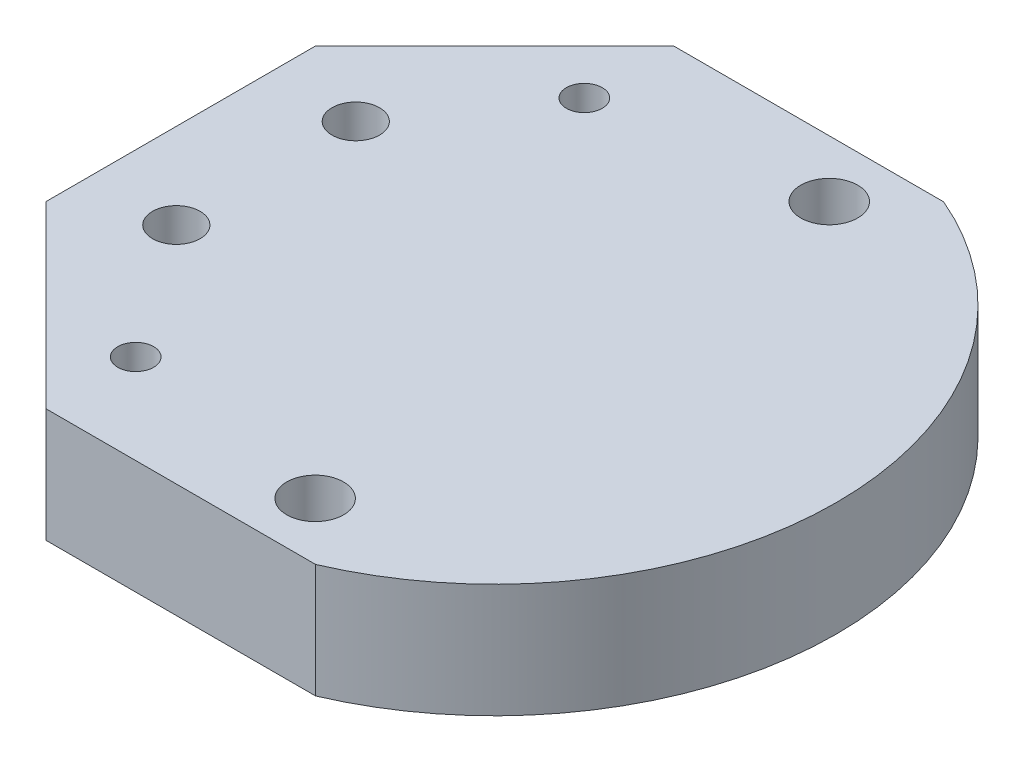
ISO-10303-21;
HEADER;
FILE_DESCRIPTION(('STEP AP214'),'2;1');
FILE_NAME('part.step','',(''),(''),'','','');
FILE_SCHEMA(('AUTOMOTIVE_DESIGN { 1 0 10303 214 1 1 1 1 }'));
ENDSEC;
DATA;
#1=APPLICATION_CONTEXT('core data for automotive mechanical design processes');
#2=APPLICATION_PROTOCOL_DEFINITION('international standard','automotive_design',2000,#1);
#3=PRODUCT_CONTEXT('',#1,'mechanical');
#4=PRODUCT('Part','Part','',(#3));
#5=PRODUCT_RELATED_PRODUCT_CATEGORY('part','',(#4));
#6=PRODUCT_DEFINITION_FORMATION('','',#4);
#7=PRODUCT_DEFINITION_CONTEXT('part definition',#1,'design');
#8=PRODUCT_DEFINITION('design','',#6,#7);
#9=PRODUCT_DEFINITION_SHAPE('','',#8);
#10=(LENGTH_UNIT() NAMED_UNIT(*) SI_UNIT(.MILLI.,.METRE.));
#11=(NAMED_UNIT(*) PLANE_ANGLE_UNIT() SI_UNIT($,.RADIAN.));
#12=(NAMED_UNIT(*) SI_UNIT($,.STERADIAN.) SOLID_ANGLE_UNIT());
#13=UNCERTAINTY_MEASURE_WITH_UNIT(LENGTH_MEASURE(1.E-05),#10,'distance_accuracy_value','');
#14=(GEOMETRIC_REPRESENTATION_CONTEXT(3) GLOBAL_UNCERTAINTY_ASSIGNED_CONTEXT((#13)) GLOBAL_UNIT_ASSIGNED_CONTEXT((#10,
#11,#12)) REPRESENTATION_CONTEXT('',''));
#15=CARTESIAN_POINT('',(0.,0.,0.));
#16=DIRECTION('',(0.,0.,1.));
#17=DIRECTION('',(1.,0.,0.));
#18=AXIS2_PLACEMENT_3D('',#15,#16,#17);
#19=CARTESIAN_POINT('',(0.,12.7,0.));
#20=DIRECTION('',(0.,-1.,0.));
#21=DIRECTION('',(0.,0.,-1.));
#22=AXIS2_PLACEMENT_3D('',#19,#20,#21);
#23=CYLINDRICAL_SURFACE('',#22,38.1);
#24=DIRECTION('',(0.,-1.,0.));
#25=VECTOR('',#24,1.);
#26=CARTESIAN_POINT('',(15.0535710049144,12.7,35.));
#27=LINE('',#26,#25);
#28=CARTESIAN_POINT('',(15.0535710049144,0.,35.));
#29=VERTEX_POINT('',#28);
#30=CARTESIAN_POINT('',(15.0535710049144,12.7,35.));
#31=VERTEX_POINT('',#30);
#32=EDGE_CURVE('E130',#29,#31,#27,.F.);
#33=ORIENTED_EDGE('',*,*,#32,.F.);
#34=CARTESIAN_POINT('',(0.,0.,0.));
#35=DIRECTION('',(0.,1.,0.));
#36=DIRECTION('',(0.,0.,1.));
#37=AXIS2_PLACEMENT_3D('',#34,#35,#36);
#38=CIRCLE('',#37,38.1);
#39=CARTESIAN_POINT('',(15.0535710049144,0.,-35.));
#40=VERTEX_POINT('',#39);
#41=EDGE_CURVE('E132',#29,#40,#38,.T.);
#42=ORIENTED_EDGE('',*,*,#41,.T.);
#43=DIRECTION('',(0.,-1.,0.));
#44=VECTOR('',#43,1.);
#45=CARTESIAN_POINT('',(15.0535710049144,12.7,-35.));
#46=LINE('',#45,#44);
#47=CARTESIAN_POINT('',(15.0535710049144,12.7,-35.));
#48=VERTEX_POINT('',#47);
#49=EDGE_CURVE('E46',#48,#40,#46,.T.);
#50=ORIENTED_EDGE('',*,*,#49,.F.);
#51=CARTESIAN_POINT('',(0.,12.7,0.));
#52=DIRECTION('',(0.,1.,0.));
#53=DIRECTION('',(0.,0.,1.));
#54=AXIS2_PLACEMENT_3D('',#51,#52,#53);
#55=CIRCLE('',#54,38.1);
#56=EDGE_CURVE('E40',#31,#48,#55,.T.);
#57=ORIENTED_EDGE('',*,*,#56,.F.);
#58=EDGE_LOOP('',(#33,#42,#50,#57));
#59=FACE_BOUND('',#58,.T.);
#60=ADVANCED_FACE('F33',(#59),#23,.T.);
#61=CARTESIAN_POINT('',(0.,12.7,0.));
#62=DIRECTION('',(0.,1.,0.));
#63=DIRECTION('',(0.,0.,1.));
#64=AXIS2_PLACEMENT_3D('',#61,#62,#63);
#65=PLANE('',#64);
#66=CARTESIAN_POINT('',(-15.,12.7,-25.));
#67=DIRECTION('',(0.,-1.,0.));
#68=DIRECTION('',(0.,0.,-1.));
#69=AXIS2_PLACEMENT_3D('',#66,#67,#68);
#70=CIRCLE('',#69,2.);
#71=CARTESIAN_POINT('',(-15.,12.7,-27.));
#72=VERTEX_POINT('',#71);
#73=EDGE_CURVE('E311',#72,#72,#70,.T.);
#74=ORIENTED_EDGE('',*,*,#73,.T.);
#75=EDGE_LOOP('',(#74));
#76=FACE_BOUND('',#75,.T.);
#77=CARTESIAN_POINT('',(-15.,12.7,25.));
#78=DIRECTION('',(0.,-1.,0.));
#79=DIRECTION('',(0.,0.,-1.));
#80=AXIS2_PLACEMENT_3D('',#77,#78,#79);
#81=CIRCLE('',#80,2.);
#82=CARTESIAN_POINT('',(-15.,12.7,23.));
#83=VERTEX_POINT('',#82);
#84=EDGE_CURVE('E319',#83,#83,#81,.T.);
#85=ORIENTED_EDGE('',*,*,#84,.T.);
#86=EDGE_LOOP('',(#85));
#87=FACE_BOUND('',#86,.T.);
#88=CARTESIAN_POINT('',(-25.475,12.7,10.));
#89=DIRECTION('',(0.,-1.,0.));
#90=DIRECTION('',(0.,0.,-1.));
#91=AXIS2_PLACEMENT_3D('',#88,#89,#90);
#92=CIRCLE('',#91,2.65);
#93=CARTESIAN_POINT('',(-25.475,12.7,7.35));
#94=VERTEX_POINT('',#93);
#95=EDGE_CURVE('E333',#94,#94,#92,.T.);
#96=ORIENTED_EDGE('',*,*,#95,.T.);
#97=EDGE_LOOP('',(#96));
#98=FACE_BOUND('',#97,.T.);
#99=CARTESIAN_POINT('',(-25.475,12.7,-10.));
#100=DIRECTION('',(0.,-1.,0.));
#101=DIRECTION('',(0.,0.,-1.));
#102=AXIS2_PLACEMENT_3D('',#99,#100,#101);
#103=CIRCLE('',#102,2.65);
#104=CARTESIAN_POINT('',(-25.475,12.7,-12.65));
#105=VERTEX_POINT('',#104);
#106=EDGE_CURVE('E345',#105,#105,#103,.T.);
#107=ORIENTED_EDGE('',*,*,#106,.T.);
#108=EDGE_LOOP('',(#107));
#109=FACE_BOUND('',#108,.T.);
#110=CARTESIAN_POINT('',(8.65,12.7,-28.65));
#111=DIRECTION('',(0.,1.,0.));
#112=DIRECTION('',(0.,0.,1.));
#113=AXIS2_PLACEMENT_3D('',#110,#111,#112);
#114=CIRCLE('',#113,3.175);
#115=CARTESIAN_POINT('',(8.65,12.7,-25.475));
#116=VERTEX_POINT('',#115);
#117=EDGE_CURVE('E348',#116,#116,#114,.T.);
#118=ORIENTED_EDGE('',*,*,#117,.F.);
#119=EDGE_LOOP('',(#118));
#120=FACE_BOUND('',#119,.T.);
#121=CARTESIAN_POINT('',(8.65,12.7,28.65));
#122=DIRECTION('',(0.,1.,0.));
#123=DIRECTION('',(0.,0.,1.));
#124=AXIS2_PLACEMENT_3D('',#121,#122,#123);
#125=CIRCLE('',#124,3.175);
#126=CARTESIAN_POINT('',(8.65,12.7,31.825));
#127=VERTEX_POINT('',#126);
#128=EDGE_CURVE('E354',#127,#127,#125,.T.);
#129=ORIENTED_EDGE('',*,*,#128,.F.);
#130=EDGE_LOOP('',(#129));
#131=FACE_BOUND('',#130,.T.);
#132=DIRECTION('',(0.707106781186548,0.,0.707106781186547));
#133=VECTOR('',#132,1.);
#134=CARTESIAN_POINT('',(-35.,12.7,15.));
#135=LINE('',#134,#133);
#136=CARTESIAN_POINT('',(-35.,12.7,15.));
#137=VERTEX_POINT('',#136);
#138=CARTESIAN_POINT('',(-15.,12.7,35.));
#139=VERTEX_POINT('',#138);
#140=EDGE_CURVE('E120',#137,#139,#135,.T.);
#141=ORIENTED_EDGE('',*,*,#140,.T.);
#142=DIRECTION('',(1.,0.,0.));
#143=VECTOR('',#142,1.);
#144=CARTESIAN_POINT('',(40.,12.7,35.));
#145=LINE('',#144,#143);
#146=EDGE_CURVE('E103',#139,#31,#145,.T.);
#147=ORIENTED_EDGE('',*,*,#146,.T.);
#148=ORIENTED_EDGE('',*,*,#56,.T.);
#149=DIRECTION('',(-1.,0.,0.));
#150=VECTOR('',#149,1.);
#151=CARTESIAN_POINT('',(40.,12.7,-35.));
#152=LINE('',#151,#150);
#153=CARTESIAN_POINT('',(-15.,12.7,-35.));
#154=VERTEX_POINT('',#153);
#155=EDGE_CURVE('E113',#48,#154,#152,.T.);
#156=ORIENTED_EDGE('',*,*,#155,.T.);
#157=DIRECTION('',(-0.707106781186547,0.,0.707106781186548));
#158=VECTOR('',#157,1.);
#159=CARTESIAN_POINT('',(-15.,12.7,-35.));
#160=LINE('',#159,#158);
#161=CARTESIAN_POINT('',(-35.,12.7,-15.));
#162=VERTEX_POINT('',#161);
#163=EDGE_CURVE('E116',#154,#162,#160,.T.);
#164=ORIENTED_EDGE('',*,*,#163,.T.);
#165=DIRECTION('',(0.,0.,1.));
#166=VECTOR('',#165,1.);
#167=CARTESIAN_POINT('',(-35.,12.7,-15.));
#168=LINE('',#167,#166);
#169=EDGE_CURVE('E91',#162,#137,#168,.T.);
#170=ORIENTED_EDGE('',*,*,#169,.T.);
#171=EDGE_LOOP('',(#141,#147,#148,#156,#164,#170));
#172=FACE_BOUND('',#171,.T.);
#173=ADVANCED_FACE('F140',(#76,#87,#98,#109,#120,#131,#172),#65,.T.);
#174=CARTESIAN_POINT('',(0.,0.,0.));
#175=DIRECTION('',(0.,1.,0.));
#176=DIRECTION('',(0.,0.,1.));
#177=AXIS2_PLACEMENT_3D('',#174,#175,#176);
#178=PLANE('',#177);
#179=CARTESIAN_POINT('',(-15.,0.,-25.));
#180=DIRECTION('',(0.,-1.,0.));
#181=DIRECTION('',(0.,0.,-1.));
#182=AXIS2_PLACEMENT_3D('',#179,#180,#181);
#183=CIRCLE('',#182,2.);
#184=CARTESIAN_POINT('',(-15.,0.,-27.));
#185=VERTEX_POINT('',#184);
#186=EDGE_CURVE('E314',#185,#185,#183,.T.);
#187=ORIENTED_EDGE('',*,*,#186,.F.);
#188=EDGE_LOOP('',(#187));
#189=FACE_BOUND('',#188,.T.);
#190=CARTESIAN_POINT('',(-15.,0.,25.));
#191=DIRECTION('',(0.,-1.,0.));
#192=DIRECTION('',(0.,0.,-1.));
#193=AXIS2_PLACEMENT_3D('',#190,#191,#192);
#194=CIRCLE('',#193,2.);
#195=CARTESIAN_POINT('',(-15.,0.,23.));
#196=VERTEX_POINT('',#195);
#197=EDGE_CURVE('E316',#196,#196,#194,.T.);
#198=ORIENTED_EDGE('',*,*,#197,.F.);
#199=EDGE_LOOP('',(#198));
#200=FACE_BOUND('',#199,.T.);
#201=CARTESIAN_POINT('',(-25.475,0.,10.));
#202=DIRECTION('',(0.,-1.,0.));
#203=DIRECTION('',(0.,0.,-1.));
#204=AXIS2_PLACEMENT_3D('',#201,#202,#203);
#205=CIRCLE('',#204,5.);
#206=CARTESIAN_POINT('',(-25.475,0.,5.));
#207=VERTEX_POINT('',#206);
#208=EDGE_CURVE('E322',#207,#207,#205,.T.);
#209=ORIENTED_EDGE('',*,*,#208,.F.);
#210=EDGE_LOOP('',(#209));
#211=FACE_BOUND('',#210,.T.);
#212=CARTESIAN_POINT('',(-25.475,0.,-10.));
#213=DIRECTION('',(0.,-1.,0.));
#214=DIRECTION('',(0.,0.,-1.));
#215=AXIS2_PLACEMENT_3D('',#212,#213,#214);
#216=CIRCLE('',#215,5.);
#217=CARTESIAN_POINT('',(-25.475,0.,-15.));
#218=VERTEX_POINT('',#217);
#219=EDGE_CURVE('E336',#218,#218,#216,.T.);
#220=ORIENTED_EDGE('',*,*,#219,.F.);
#221=EDGE_LOOP('',(#220));
#222=FACE_BOUND('',#221,.T.);
#223=CARTESIAN_POINT('',(8.65,0.,-28.65));
#224=DIRECTION('',(0.,1.,0.));
#225=DIRECTION('',(0.,0.,1.));
#226=AXIS2_PLACEMENT_3D('',#223,#224,#225);
#227=CIRCLE('',#226,3.175);
#228=CARTESIAN_POINT('',(8.65,0.,-25.475));
#229=VERTEX_POINT('',#228);
#230=EDGE_CURVE('E351',#229,#229,#227,.T.);
#231=ORIENTED_EDGE('',*,*,#230,.T.);
#232=EDGE_LOOP('',(#231));
#233=FACE_BOUND('',#232,.T.);
#234=CARTESIAN_POINT('',(8.65,0.,28.65));
#235=DIRECTION('',(0.,1.,0.));
#236=DIRECTION('',(0.,0.,1.));
#237=AXIS2_PLACEMENT_3D('',#234,#235,#236);
#238=CIRCLE('',#237,3.175);
#239=CARTESIAN_POINT('',(8.65,0.,31.825));
#240=VERTEX_POINT('',#239);
#241=EDGE_CURVE('E117',#240,#240,#238,.T.);
#242=ORIENTED_EDGE('',*,*,#241,.T.);
#243=EDGE_LOOP('',(#242));
#244=FACE_BOUND('',#243,.T.);
#245=DIRECTION('',(1.,0.,0.));
#246=VECTOR('',#245,1.);
#247=CARTESIAN_POINT('',(40.,0.,35.));
#248=LINE('',#247,#246);
#249=CARTESIAN_POINT('',(-15.,0.,35.));
#250=VERTEX_POINT('',#249);
#251=EDGE_CURVE('E54',#250,#29,#248,.T.);
#252=ORIENTED_EDGE('',*,*,#251,.F.);
#253=DIRECTION('',(0.707106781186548,0.,0.707106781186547));
#254=VECTOR('',#253,1.);
#255=CARTESIAN_POINT('',(-35.,0.,15.));
#256=LINE('',#255,#254);
#257=CARTESIAN_POINT('',(-35.,0.,15.));
#258=VERTEX_POINT('',#257);
#259=EDGE_CURVE('E107',#258,#250,#256,.T.);
#260=ORIENTED_EDGE('',*,*,#259,.F.);
#261=DIRECTION('',(0.,0.,1.));
#262=VECTOR('',#261,1.);
#263=CARTESIAN_POINT('',(-35.,0.,-15.));
#264=LINE('',#263,#262);
#265=CARTESIAN_POINT('',(-35.,0.,-15.));
#266=VERTEX_POINT('',#265);
#267=EDGE_CURVE('E88',#266,#258,#264,.T.);
#268=ORIENTED_EDGE('',*,*,#267,.F.);
#269=DIRECTION('',(-0.707106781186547,0.,0.707106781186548));
#270=VECTOR('',#269,1.);
#271=CARTESIAN_POINT('',(-15.,0.,-35.));
#272=LINE('',#271,#270);
#273=CARTESIAN_POINT('',(-15.,0.,-35.));
#274=VERTEX_POINT('',#273);
#275=EDGE_CURVE('E100',#274,#266,#272,.T.);
#276=ORIENTED_EDGE('',*,*,#275,.F.);
#277=DIRECTION('',(-1.,0.,0.));
#278=VECTOR('',#277,1.);
#279=CARTESIAN_POINT('',(0.,0.,-35.));
#280=LINE('',#279,#278);
#281=EDGE_CURVE('E12',#40,#274,#280,.T.);
#282=ORIENTED_EDGE('',*,*,#281,.F.);
#283=ORIENTED_EDGE('',*,*,#41,.F.);
#284=EDGE_LOOP('',(#252,#260,#268,#276,#282,#283));
#285=FACE_BOUND('',#284,.T.);
#286=ADVANCED_FACE('F105',(#189,#200,#211,#222,#233,#244,#285),#178,.F.);
#287=CARTESIAN_POINT('',(40.,0.,35.));
#288=DIRECTION('',(0.,0.,1.));
#289=DIRECTION('',(1.,0.,0.));
#290=AXIS2_PLACEMENT_3D('',#287,#288,#289);
#291=PLANE('',#290);
#292=ORIENTED_EDGE('',*,*,#32,.T.);
#293=ORIENTED_EDGE('',*,*,#146,.F.);
#294=DIRECTION('',(0.,1.,0.));
#295=VECTOR('',#294,1.);
#296=CARTESIAN_POINT('',(-15.,0.,35.));
#297=LINE('',#296,#295);
#298=EDGE_CURVE('E125',#250,#139,#297,.T.);
#299=ORIENTED_EDGE('',*,*,#298,.F.);
#300=ORIENTED_EDGE('',*,*,#251,.T.);
#301=EDGE_LOOP('',(#292,#293,#299,#300));
#302=FACE_BOUND('',#301,.T.);
#303=ADVANCED_FACE('F143',(#302),#291,.T.);
#304=CARTESIAN_POINT('',(40.,0.,-35.));
#305=DIRECTION('',(0.,0.,-1.));
#306=DIRECTION('',(-1.,0.,0.));
#307=AXIS2_PLACEMENT_3D('',#304,#305,#306);
#308=PLANE('',#307);
#309=ORIENTED_EDGE('',*,*,#49,.T.);
#310=ORIENTED_EDGE('',*,*,#281,.T.);
#311=DIRECTION('',(0.,1.,0.));
#312=VECTOR('',#311,1.);
#313=CARTESIAN_POINT('',(-15.,0.,-35.));
#314=LINE('',#313,#312);
#315=EDGE_CURVE('E96',#274,#154,#314,.T.);
#316=ORIENTED_EDGE('',*,*,#315,.T.);
#317=ORIENTED_EDGE('',*,*,#155,.F.);
#318=EDGE_LOOP('',(#309,#310,#316,#317));
#319=FACE_BOUND('',#318,.T.);
#320=ADVANCED_FACE('F138',(#319),#308,.T.);
#321=CARTESIAN_POINT('',(-35.,0.,15.));
#322=DIRECTION('',(-0.707106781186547,0.,0.707106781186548));
#323=DIRECTION('',(0.707106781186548,0.,0.707106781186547));
#324=AXIS2_PLACEMENT_3D('',#321,#322,#323);
#325=PLANE('',#324);
#326=ORIENTED_EDGE('',*,*,#140,.F.);
#327=DIRECTION('',(0.,1.,0.));
#328=VECTOR('',#327,1.);
#329=CARTESIAN_POINT('',(-35.,0.,15.));
#330=LINE('',#329,#328);
#331=EDGE_CURVE('E95',#258,#137,#330,.T.);
#332=ORIENTED_EDGE('',*,*,#331,.F.);
#333=ORIENTED_EDGE('',*,*,#259,.T.);
#334=ORIENTED_EDGE('',*,*,#298,.T.);
#335=EDGE_LOOP('',(#326,#332,#333,#334));
#336=FACE_BOUND('',#335,.T.);
#337=ADVANCED_FACE('F145',(#336),#325,.T.);
#338=CARTESIAN_POINT('',(-35.,0.,-15.));
#339=DIRECTION('',(-1.,0.,0.));
#340=DIRECTION('',(0.,0.,1.));
#341=AXIS2_PLACEMENT_3D('',#338,#339,#340);
#342=PLANE('',#341);
#343=ORIENTED_EDGE('',*,*,#169,.F.);
#344=DIRECTION('',(0.,1.,0.));
#345=VECTOR('',#344,1.);
#346=CARTESIAN_POINT('',(-35.,0.,-15.));
#347=LINE('',#346,#345);
#348=EDGE_CURVE('E84',#266,#162,#347,.T.);
#349=ORIENTED_EDGE('',*,*,#348,.F.);
#350=ORIENTED_EDGE('',*,*,#267,.T.);
#351=ORIENTED_EDGE('',*,*,#331,.T.);
#352=EDGE_LOOP('',(#343,#349,#350,#351));
#353=FACE_BOUND('',#352,.T.);
#354=ADVANCED_FACE('F86',(#353),#342,.T.);
#355=CARTESIAN_POINT('',(-15.,0.,-35.));
#356=DIRECTION('',(-0.707106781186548,0.,-0.707106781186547));
#357=DIRECTION('',(-0.707106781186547,0.,0.707106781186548));
#358=AXIS2_PLACEMENT_3D('',#355,#356,#357);
#359=PLANE('',#358);
#360=ORIENTED_EDGE('',*,*,#163,.F.);
#361=ORIENTED_EDGE('',*,*,#315,.F.);
#362=ORIENTED_EDGE('',*,*,#275,.T.);
#363=ORIENTED_EDGE('',*,*,#348,.T.);
#364=EDGE_LOOP('',(#360,#361,#362,#363));
#365=FACE_BOUND('',#364,.T.);
#366=ADVANCED_FACE('F101',(#365),#359,.T.);
#367=CARTESIAN_POINT('',(8.65,12.7,28.65));
#368=DIRECTION('',(0.,1.,0.));
#369=DIRECTION('',(0.,0.,1.));
#370=AXIS2_PLACEMENT_3D('',#367,#368,#369);
#371=CYLINDRICAL_SURFACE('',#370,3.175);
#372=ORIENTED_EDGE('',*,*,#241,.F.);
#373=EDGE_LOOP('',(#372));
#374=FACE_BOUND('',#373,.T.);
#375=ORIENTED_EDGE('',*,*,#128,.T.);
#376=EDGE_LOOP('',(#375));
#377=FACE_BOUND('',#376,.T.);
#378=ADVANCED_FACE('F169',(#374,#377),#371,.F.);
#379=CARTESIAN_POINT('',(8.65,12.7,-28.65));
#380=DIRECTION('',(0.,1.,0.));
#381=DIRECTION('',(0.,0.,1.));
#382=AXIS2_PLACEMENT_3D('',#379,#380,#381);
#383=CYLINDRICAL_SURFACE('',#382,3.175);
#384=ORIENTED_EDGE('',*,*,#230,.F.);
#385=EDGE_LOOP('',(#384));
#386=FACE_BOUND('',#385,.T.);
#387=ORIENTED_EDGE('',*,*,#117,.T.);
#388=EDGE_LOOP('',(#387));
#389=FACE_BOUND('',#388,.T.);
#390=ADVANCED_FACE('F173',(#386,#389),#383,.F.);
#391=CARTESIAN_POINT('',(-25.475,0.,-10.));
#392=DIRECTION('',(0.,-1.,0.));
#393=DIRECTION('',(0.,0.,-1.));
#394=AXIS2_PLACEMENT_3D('',#391,#392,#393);
#395=CYLINDRICAL_SURFACE('',#394,2.65);
#396=ORIENTED_EDGE('',*,*,#106,.F.);
#397=EDGE_LOOP('',(#396));
#398=FACE_BOUND('',#397,.T.);
#399=CARTESIAN_POINT('',(-25.475,6.,-10.));
#400=DIRECTION('',(0.,-1.,0.));
#401=DIRECTION('',(0.,0.,-1.));
#402=AXIS2_PLACEMENT_3D('',#399,#400,#401);
#403=CIRCLE('',#402,2.65);
#404=CARTESIAN_POINT('',(-25.475,6.,-12.65));
#405=VERTEX_POINT('',#404);
#406=EDGE_CURVE('E342',#405,#405,#403,.T.);
#407=ORIENTED_EDGE('',*,*,#406,.T.);
#408=EDGE_LOOP('',(#407));
#409=FACE_BOUND('',#408,.T.);
#410=ADVANCED_FACE('F179',(#398,#409),#395,.F.);
#411=CARTESIAN_POINT('',(-22.825,6.,-10.));
#412=DIRECTION('',(0.,1.,0.));
#413=DIRECTION('',(0.,0.,1.));
#414=AXIS2_PLACEMENT_3D('',#411,#412,#413);
#415=PLANE('',#414);
#416=ORIENTED_EDGE('',*,*,#406,.F.);
#417=EDGE_LOOP('',(#416));
#418=FACE_BOUND('',#417,.T.);
#419=CARTESIAN_POINT('',(-25.475,6.,-10.));
#420=DIRECTION('',(0.,-1.,0.));
#421=DIRECTION('',(0.,0.,-1.));
#422=AXIS2_PLACEMENT_3D('',#419,#420,#421);
#423=CIRCLE('',#422,5.);
#424=CARTESIAN_POINT('',(-25.475,6.,-15.));
#425=VERTEX_POINT('',#424);
#426=EDGE_CURVE('E339',#425,#425,#423,.T.);
#427=ORIENTED_EDGE('',*,*,#426,.T.);
#428=EDGE_LOOP('',(#427));
#429=FACE_BOUND('',#428,.T.);
#430=ADVANCED_FACE('F227',(#418,#429),#415,.F.);
#431=CARTESIAN_POINT('',(-25.475,0.,-10.));
#432=DIRECTION('',(0.,-1.,0.));
#433=DIRECTION('',(0.,0.,-1.));
#434=AXIS2_PLACEMENT_3D('',#431,#432,#433);
#435=CYLINDRICAL_SURFACE('',#434,5.);
#436=ORIENTED_EDGE('',*,*,#426,.F.);
#437=EDGE_LOOP('',(#436));
#438=FACE_BOUND('',#437,.T.);
#439=ORIENTED_EDGE('',*,*,#219,.T.);
#440=EDGE_LOOP('',(#439));
#441=FACE_BOUND('',#440,.T.);
#442=ADVANCED_FACE('F236',(#438,#441),#435,.F.);
#443=CARTESIAN_POINT('',(-25.475,0.,10.));
#444=DIRECTION('',(0.,-1.,0.));
#445=DIRECTION('',(0.,0.,-1.));
#446=AXIS2_PLACEMENT_3D('',#443,#444,#445);
#447=CYLINDRICAL_SURFACE('',#446,2.65);
#448=ORIENTED_EDGE('',*,*,#95,.F.);
#449=EDGE_LOOP('',(#448));
#450=FACE_BOUND('',#449,.T.);
#451=CARTESIAN_POINT('',(-25.475,6.,10.));
#452=DIRECTION('',(0.,-1.,0.));
#453=DIRECTION('',(0.,0.,-1.));
#454=AXIS2_PLACEMENT_3D('',#451,#452,#453);
#455=CIRCLE('',#454,2.65);
#456=CARTESIAN_POINT('',(-25.475,6.,7.35));
#457=VERTEX_POINT('',#456);
#458=EDGE_CURVE('E330',#457,#457,#455,.T.);
#459=ORIENTED_EDGE('',*,*,#458,.T.);
#460=EDGE_LOOP('',(#459));
#461=FACE_BOUND('',#460,.T.);
#462=ADVANCED_FACE('F246',(#450,#461),#447,.F.);
#463=CARTESIAN_POINT('',(-22.825,6.,10.));
#464=DIRECTION('',(0.,1.,0.));
#465=DIRECTION('',(0.,0.,1.));
#466=AXIS2_PLACEMENT_3D('',#463,#464,#465);
#467=PLANE('',#466);
#468=ORIENTED_EDGE('',*,*,#458,.F.);
#469=EDGE_LOOP('',(#468));
#470=FACE_BOUND('',#469,.T.);
#471=CARTESIAN_POINT('',(-25.475,6.,10.));
#472=DIRECTION('',(0.,-1.,0.));
#473=DIRECTION('',(0.,0.,-1.));
#474=AXIS2_PLACEMENT_3D('',#471,#472,#473);
#475=CIRCLE('',#474,5.);
#476=CARTESIAN_POINT('',(-25.475,6.,5.));
#477=VERTEX_POINT('',#476);
#478=EDGE_CURVE('E327',#477,#477,#475,.T.);
#479=ORIENTED_EDGE('',*,*,#478,.T.);
#480=EDGE_LOOP('',(#479));
#481=FACE_BOUND('',#480,.T.);
#482=ADVANCED_FACE('F256',(#470,#481),#467,.F.);
#483=CARTESIAN_POINT('',(-25.475,0.,10.));
#484=DIRECTION('',(0.,-1.,0.));
#485=DIRECTION('',(0.,0.,-1.));
#486=AXIS2_PLACEMENT_3D('',#483,#484,#485);
#487=CYLINDRICAL_SURFACE('',#486,5.);
#488=ORIENTED_EDGE('',*,*,#478,.F.);
#489=EDGE_LOOP('',(#488));
#490=FACE_BOUND('',#489,.T.);
#491=ORIENTED_EDGE('',*,*,#208,.T.);
#492=EDGE_LOOP('',(#491));
#493=FACE_BOUND('',#492,.T.);
#494=ADVANCED_FACE('F266',(#490,#493),#487,.F.);
#495=CARTESIAN_POINT('',(-15.,12.7,25.));
#496=DIRECTION('',(0.,-1.,0.));
#497=DIRECTION('',(0.,0.,-1.));
#498=AXIS2_PLACEMENT_3D('',#495,#496,#497);
#499=CYLINDRICAL_SURFACE('',#498,2.);
#500=ORIENTED_EDGE('',*,*,#84,.F.);
#501=EDGE_LOOP('',(#500));
#502=FACE_BOUND('',#501,.T.);
#503=ORIENTED_EDGE('',*,*,#197,.T.);
#504=EDGE_LOOP('',(#503));
#505=FACE_BOUND('',#504,.T.);
#506=ADVANCED_FACE('F275',(#502,#505),#499,.F.);
#507=CARTESIAN_POINT('',(-15.,12.7,-25.));
#508=DIRECTION('',(0.,-1.,0.));
#509=DIRECTION('',(0.,0.,-1.));
#510=AXIS2_PLACEMENT_3D('',#507,#508,#509);
#511=CYLINDRICAL_SURFACE('',#510,2.);
#512=ORIENTED_EDGE('',*,*,#73,.F.);
#513=EDGE_LOOP('',(#512));
#514=FACE_BOUND('',#513,.T.);
#515=ORIENTED_EDGE('',*,*,#186,.T.);
#516=EDGE_LOOP('',(#515));
#517=FACE_BOUND('',#516,.T.);
#518=ADVANCED_FACE('F295',(#514,#517),#511,.F.);
#519=CLOSED_SHELL('',(#60,#173,#286,#303,#320,#337,#354,#366,#378,#390,#410,#430,#442,#462,#482,
#494,#506,#518));
#520=MANIFOLD_SOLID_BREP('B2',#519);
#521=ADVANCED_BREP_SHAPE_REPRESENTATION('',(#18,#520),#14);
#522=SHAPE_DEFINITION_REPRESENTATION(#9,#521);
ENDSEC;
END-ISO-10303-21;
